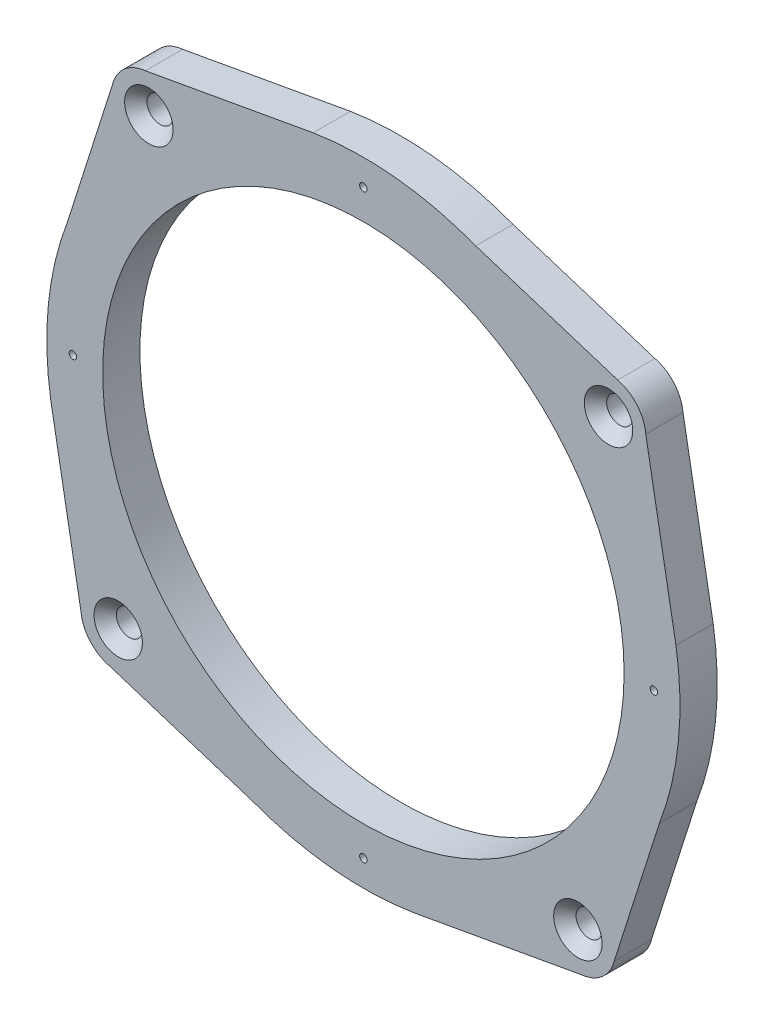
from build123d import *

# Parameters (mm, degrees)
SKETCH_1_R      = 1
SKETCH_1_R_2    = 70
SKETCH_1_R_3    = 3.5
EXTRUDE_1_DEPTH = 10
CHAMFER_1_SIZE  = 3


with BuildPart() as part:
    # Sketch 1 → Extrude 1 (new body)
    with BuildSketch(Plane.XY):
        with BuildLine():
            ThreePointArc((475.195771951, 392.272943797), (469.60063206, 389.898454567), (466.39835072, 384.732297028))
            Line((466.39835072, 384.732297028), (454.272735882, 346.629271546))
            ThreePointArc((454.272735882, 346.629271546), (449.175104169, 325.091784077), (449.810541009, 302.968370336))
            Line((449.810541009, 302.968370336), (457.911393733, 257.910837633))
            ThreePointArc((457.911393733, 257.910837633), (460.285882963, 252.315697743), (465.452040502, 249.113416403))
            Line((465.452040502, 249.113416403), (503.555065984, 236.987801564))
            ThreePointArc((503.555065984, 236.987801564), (525.092553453, 231.890169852), (547.215967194, 232.525606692))
            Line((547.215967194, 232.525606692), (592.273499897, 240.626459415))
            ThreePointArc((592.273499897, 240.626459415), (597.868639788, 243.000948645), (601.070921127, 248.167106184))
            Line((601.070921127, 248.167106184), (613.196535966, 286.270131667))
            ThreePointArc((613.196535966, 286.270131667), (618.294167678, 307.807619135), (617.658730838, 329.931032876))
            Line((617.658730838, 329.931032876), (609.557878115, 374.98856558))
            ThreePointArc((609.557878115, 374.98856558), (607.183388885, 380.58370547), (602.017231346, 383.78598681))
            Line((602.017231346, 383.78598681), (563.914205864, 395.911601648))
            ThreePointArc((563.914205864, 395.911601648), (542.376718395, 401.009233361), (520.253304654, 400.373796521))
            Line((520.253304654, 400.373796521), (475.195771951, 392.272943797))
        make_face()
        with Locations((533.734635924, 238.449701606)):
            Circle(SKETCH_1_R, mode=Mode.SUBTRACT)
        with Locations((533.734635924, 316.449701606)):
            Circle(SKETCH_1_R_2, mode=Mode.SUBTRACT)
        with Locations((611.734635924, 316.449701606)):
            Circle(SKETCH_1_R, mode=Mode.SUBTRACT)
        with Locations((455.734635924, 316.449701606)):
            Circle(SKETCH_1_R, mode=Mode.SUBTRACT)
        with Locations((533.734635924, 394.449701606)):
            Circle(SKETCH_1_R, mode=Mode.SUBTRACT)
        with Locations((476.139581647, 382.269680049)):
            Circle(SKETCH_1_R_3, mode=Mode.SUBTRACT)
        with Locations((599.554614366, 374.044755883)):
            Circle(SKETCH_1_R_3, mode=Mode.SUBTRACT)
        with Locations((467.914657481, 258.85464733)):
            Circle(SKETCH_1_R_3, mode=Mode.SUBTRACT)
        with Locations((591.3296902, 250.629723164)):
            Circle(SKETCH_1_R_3, mode=Mode.SUBTRACT)
    extrude(amount=EXTRUDE_1_DEPTH)

    # Chamfer 1
    chamfer_1_edges = [part.edges().sort_by_distance(p)[0] for p in [
        (464.414657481, 258.85464733, 10),
        (472.639581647, 382.269680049, 10),
        (587.8296902, 250.629723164, 10),
        (596.054614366, 374.044755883, 10),
    ]]
    chamfer(chamfer_1_edges, length=CHAMFER_1_SIZE)


solid = part.part
